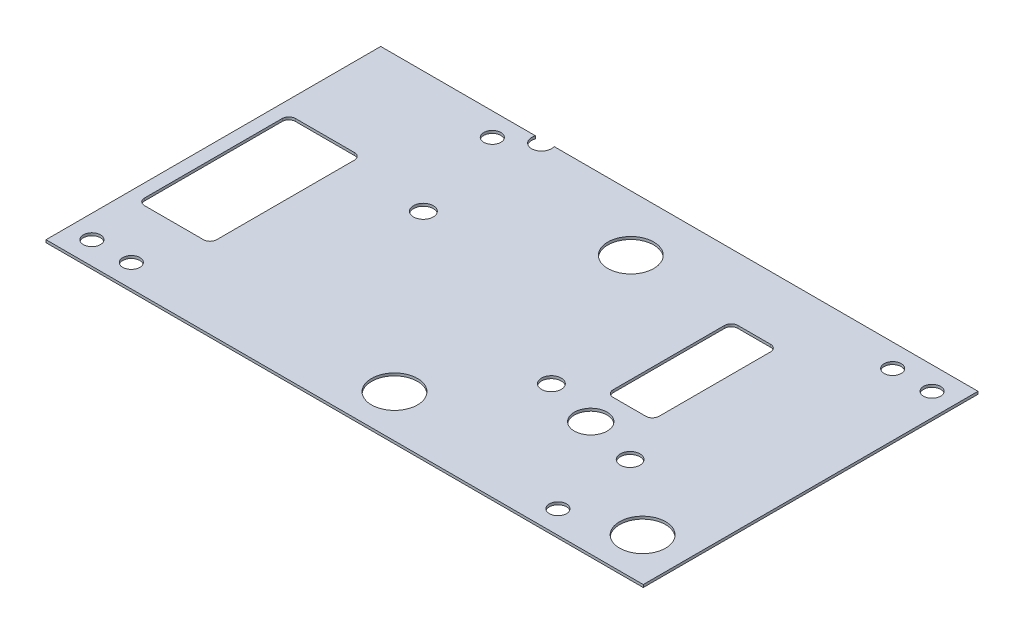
ISO-10303-21;
HEADER;
FILE_DESCRIPTION(('STEP AP214'),'2;1');
FILE_NAME('part.step','',(''),(''),'','','');
FILE_SCHEMA(('AUTOMOTIVE_DESIGN { 1 0 10303 214 1 1 1 1 }'));
ENDSEC;
DATA;
#1=APPLICATION_CONTEXT('core data for automotive mechanical design processes');
#2=APPLICATION_PROTOCOL_DEFINITION('international standard','automotive_design',2000,#1);
#3=PRODUCT_CONTEXT('',#1,'mechanical');
#4=PRODUCT('Part','Part','',(#3));
#5=PRODUCT_RELATED_PRODUCT_CATEGORY('part','',(#4));
#6=PRODUCT_DEFINITION_FORMATION('','',#4);
#7=PRODUCT_DEFINITION_CONTEXT('part definition',#1,'design');
#8=PRODUCT_DEFINITION('design','',#6,#7);
#9=PRODUCT_DEFINITION_SHAPE('','',#8);
#10=(LENGTH_UNIT() NAMED_UNIT(*) SI_UNIT(.MILLI.,.METRE.));
#11=(NAMED_UNIT(*) PLANE_ANGLE_UNIT() SI_UNIT($,.RADIAN.));
#12=(NAMED_UNIT(*) SI_UNIT($,.STERADIAN.) SOLID_ANGLE_UNIT());
#13=UNCERTAINTY_MEASURE_WITH_UNIT(LENGTH_MEASURE(1.E-05),#10,'distance_accuracy_value','');
#14=(GEOMETRIC_REPRESENTATION_CONTEXT(3) GLOBAL_UNCERTAINTY_ASSIGNED_CONTEXT((#13)) GLOBAL_UNIT_ASSIGNED_CONTEXT((#10,
#11,#12)) REPRESENTATION_CONTEXT('',''));
#15=CARTESIAN_POINT('',(0.,0.,0.));
#16=DIRECTION('',(0.,0.,1.));
#17=DIRECTION('',(1.,0.,0.));
#18=AXIS2_PLACEMENT_3D('',#15,#16,#17);
#19=CARTESIAN_POINT('',(-327.500732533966,-186.420000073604,306.499993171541));
#20=DIRECTION('',(0.,-1.,0.));
#21=DIRECTION('',(0.,0.,-1.));
#22=AXIS2_PLACEMENT_3D('',#19,#20,#21);
#23=PLANE('',#22);
#24=CARTESIAN_POINT('',(-202.501514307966,-186.420000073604,143.999992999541));
#25=DIRECTION('',(0.,-1.,0.));
#26=DIRECTION('',(0.,0.,-1.));
#27=AXIS2_PLACEMENT_3D('',#24,#25,#26);
#28=CIRCLE('',#27,7.50000000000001);
#29=CARTESIAN_POINT('',(-202.501514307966,-186.420000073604,136.499992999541));
#30=VERTEX_POINT('',#29);
#31=EDGE_CURVE('E368',#30,#30,#28,.T.);
#32=ORIENTED_EDGE('',*,*,#31,.T.);
#33=EDGE_LOOP('',(#32));
#34=FACE_BOUND('',#33,.T.);
#35=CARTESIAN_POINT('',(79.9992674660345,-186.420000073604,68.999993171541));
#36=DIRECTION('',(0.,-1.,0.));
#37=DIRECTION('',(0.,0.,-1.));
#38=AXIS2_PLACEMENT_3D('',#35,#36,#37);
#39=CIRCLE('',#38,6.5);
#40=CARTESIAN_POINT('',(79.9992674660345,-186.420000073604,62.499993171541));
#41=VERTEX_POINT('',#40);
#42=EDGE_CURVE('E366',#41,#41,#39,.T.);
#43=ORIENTED_EDGE('',*,*,#42,.T.);
#44=EDGE_LOOP('',(#43));
#45=FACE_BOUND('',#44,.T.);
#46=CARTESIAN_POINT('',(109.999267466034,-186.420000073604,68.999993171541));
#47=DIRECTION('',(0.,-1.,0.));
#48=DIRECTION('',(0.,0.,-1.));
#49=AXIS2_PLACEMENT_3D('',#46,#47,#48);
#50=CIRCLE('',#49,6.5);
#51=CARTESIAN_POINT('',(109.999267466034,-186.420000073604,62.499993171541));
#52=VERTEX_POINT('',#51);
#53=EDGE_CURVE('E363',#52,#52,#50,.T.);
#54=ORIENTED_EDGE('',*,*,#53,.T.);
#55=EDGE_LOOP('',(#54));
#56=FACE_BOUND('',#55,.T.);
#57=CARTESIAN_POINT('',(44.9992674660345,-186.420000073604,288.999993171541));
#58=DIRECTION('',(0.,-1.,0.));
#59=DIRECTION('',(0.,0.,-1.));
#60=AXIS2_PLACEMENT_3D('',#57,#58,#59);
#61=CIRCLE('',#60,6.50000000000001);
#62=CARTESIAN_POINT('',(44.9992674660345,-186.420000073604,282.499993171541));
#63=VERTEX_POINT('',#62);
#64=EDGE_CURVE('E360',#63,#63,#61,.T.);
#65=ORIENTED_EDGE('',*,*,#64,.T.);
#66=EDGE_LOOP('',(#65));
#67=FACE_BOUND('',#66,.T.);
#68=CARTESIAN_POINT('',(-225.000732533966,-186.420000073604,68.999993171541));
#69=DIRECTION('',(0.,-1.,0.));
#70=DIRECTION('',(0.,0.,-1.));
#71=AXIS2_PLACEMENT_3D('',#68,#69,#70);
#72=CIRCLE('',#71,6.5);
#73=CARTESIAN_POINT('',(-225.000732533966,-186.420000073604,62.4999931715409));
#74=VERTEX_POINT('',#73);
#75=EDGE_CURVE('E357',#74,#74,#72,.T.);
#76=ORIENTED_EDGE('',*,*,#75,.T.);
#77=EDGE_LOOP('',(#76));
#78=FACE_BOUND('',#77,.T.);
#79=CARTESIAN_POINT('',(-310.000732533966,-186.420000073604,288.999993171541));
#80=DIRECTION('',(0.,-1.,0.));
#81=DIRECTION('',(0.,0.,-1.));
#82=AXIS2_PLACEMENT_3D('',#79,#80,#81);
#83=CIRCLE('',#82,6.50000000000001);
#84=CARTESIAN_POINT('',(-310.000732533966,-186.420000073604,282.499993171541));
#85=VERTEX_POINT('',#84);
#86=EDGE_CURVE('E354',#85,#85,#83,.T.);
#87=ORIENTED_EDGE('',*,*,#86,.T.);
#88=EDGE_LOOP('',(#87));
#89=FACE_BOUND('',#88,.T.);
#90=CARTESIAN_POINT('',(-280.000732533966,-186.420000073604,288.999993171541));
#91=DIRECTION('',(0.,-1.,0.));
#92=DIRECTION('',(0.,0.,-1.));
#93=AXIS2_PLACEMENT_3D('',#90,#91,#92);
#94=CIRCLE('',#93,6.50000000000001);
#95=CARTESIAN_POINT('',(-280.000732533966,-186.420000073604,282.499993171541));
#96=VERTEX_POINT('',#95);
#97=EDGE_CURVE('E351',#96,#96,#94,.T.);
#98=ORIENTED_EDGE('',*,*,#97,.T.);
#99=EDGE_LOOP('',(#98));
#100=FACE_BOUND('',#99,.T.);
#101=CARTESIAN_POINT('',(94.5000000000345,-186.420000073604,273.999999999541));
#102=DIRECTION('',(0.,-1.,0.));
#103=DIRECTION('',(0.,0.,-1.));
#104=AXIS2_PLACEMENT_3D('',#101,#102,#103);
#105=CIRCLE('',#104,17.5);
#106=CARTESIAN_POINT('',(94.5000000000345,-186.420000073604,256.499999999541));
#107=VERTEX_POINT('',#106);
#108=EDGE_CURVE('E348',#107,#107,#105,.T.);
#109=ORIENTED_EDGE('',*,*,#108,.T.);
#110=EDGE_LOOP('',(#109));
#111=FACE_BOUND('',#110,.T.);
#112=CARTESIAN_POINT('',(-94.4999999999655,-186.420000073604,273.999999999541));
#113=DIRECTION('',(0.,-1.,0.));
#114=DIRECTION('',(0.,0.,-1.));
#115=AXIS2_PLACEMENT_3D('',#112,#113,#114);
#116=CIRCLE('',#115,17.5);
#117=CARTESIAN_POINT('',(-94.4999999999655,-186.420000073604,256.499999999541));
#118=VERTEX_POINT('',#117);
#119=EDGE_CURVE('E345',#118,#118,#116,.T.);
#120=ORIENTED_EDGE('',*,*,#119,.T.);
#121=EDGE_LOOP('',(#120));
#122=FACE_BOUND('',#121,.T.);
#123=CARTESIAN_POINT('',(-94.4999999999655,-186.420000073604,93.999999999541));
#124=DIRECTION('',(0.,-1.,0.));
#125=DIRECTION('',(0.,0.,-1.));
#126=AXIS2_PLACEMENT_3D('',#123,#124,#125);
#127=CIRCLE('',#126,17.5);
#128=CARTESIAN_POINT('',(-94.4999999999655,-186.420000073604,76.499999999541));
#129=VERTEX_POINT('',#128);
#130=EDGE_CURVE('E218',#129,#129,#127,.T.);
#131=ORIENTED_EDGE('',*,*,#130,.T.);
#132=EDGE_LOOP('',(#131));
#133=FACE_BOUND('',#132,.T.);
#134=DIRECTION('',(-1.,0.,0.));
#135=VECTOR('',#134,1.);
#136=CARTESIAN_POINT('',(-267.500732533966,-186.420000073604,131.499993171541));
#137=LINE('',#136,#135);
#138=CARTESIAN_POINT('',(-312.500732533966,-186.420000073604,131.499993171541));
#139=VERTEX_POINT('',#138);
#140=CARTESIAN_POINT('',(-267.500732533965,-186.420000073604,131.499993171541));
#141=VERTEX_POINT('',#140);
#142=EDGE_CURVE('E215',#139,#141,#137,.F.);
#143=ORIENTED_EDGE('',*,*,#142,.T.);
#144=CARTESIAN_POINT('',(-267.500732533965,-186.420000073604,136.499993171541));
#145=DIRECTION('',(0.,-1.,0.));
#146=DIRECTION('',(0.,0.,-1.));
#147=AXIS2_PLACEMENT_3D('',#144,#145,#146);
#148=CIRCLE('',#147,5.);
#149=CARTESIAN_POINT('',(-262.500732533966,-186.420000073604,136.499993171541));
#150=VERTEX_POINT('',#149);
#151=EDGE_CURVE('E341',#141,#150,#148,.T.);
#152=ORIENTED_EDGE('',*,*,#151,.T.);
#153=DIRECTION('',(0.,0.,1.));
#154=VECTOR('',#153,1.);
#155=CARTESIAN_POINT('',(-262.500732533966,-186.420000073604,241.499993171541));
#156=LINE('',#155,#154);
#157=CARTESIAN_POINT('',(-262.500732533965,-186.420000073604,241.499993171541));
#158=VERTEX_POINT('',#157);
#159=EDGE_CURVE('E227',#150,#158,#156,.T.);
#160=ORIENTED_EDGE('',*,*,#159,.T.);
#161=CARTESIAN_POINT('',(-267.500732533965,-186.420000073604,241.499993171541));
#162=DIRECTION('',(0.,-1.,0.));
#163=DIRECTION('',(0.,0.,-1.));
#164=AXIS2_PLACEMENT_3D('',#161,#162,#163);
#165=CIRCLE('',#164,5.);
#166=CARTESIAN_POINT('',(-267.500732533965,-186.420000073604,246.499993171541));
#167=VERTEX_POINT('',#166);
#168=EDGE_CURVE('E339',#158,#167,#165,.T.);
#169=ORIENTED_EDGE('',*,*,#168,.T.);
#170=DIRECTION('',(1.,0.,0.));
#171=VECTOR('',#170,1.);
#172=CARTESIAN_POINT('',(-312.500732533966,-186.420000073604,246.499993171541));
#173=LINE('',#172,#171);
#174=CARTESIAN_POINT('',(-312.500732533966,-186.420000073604,246.499993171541));
#175=VERTEX_POINT('',#174);
#176=EDGE_CURVE('E223',#167,#175,#173,.F.);
#177=ORIENTED_EDGE('',*,*,#176,.T.);
#178=CARTESIAN_POINT('',(-312.500732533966,-186.420000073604,241.499993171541));
#179=DIRECTION('',(0.,-1.,0.));
#180=DIRECTION('',(0.,0.,-1.));
#181=AXIS2_PLACEMENT_3D('',#178,#179,#180);
#182=CIRCLE('',#181,5.);
#183=CARTESIAN_POINT('',(-317.500732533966,-186.420000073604,241.499993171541));
#184=VERTEX_POINT('',#183);
#185=EDGE_CURVE('E337',#175,#184,#182,.T.);
#186=ORIENTED_EDGE('',*,*,#185,.T.);
#187=DIRECTION('',(0.,0.,1.));
#188=VECTOR('',#187,1.);
#189=CARTESIAN_POINT('',(-317.500732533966,-186.420000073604,136.499993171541));
#190=LINE('',#189,#188);
#191=CARTESIAN_POINT('',(-317.500732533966,-186.420000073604,136.499993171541));
#192=VERTEX_POINT('',#191);
#193=EDGE_CURVE('E219',#184,#192,#190,.F.);
#194=ORIENTED_EDGE('',*,*,#193,.T.);
#195=CARTESIAN_POINT('',(-312.500732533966,-186.420000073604,136.499993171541));
#196=DIRECTION('',(0.,-1.,0.));
#197=DIRECTION('',(0.,0.,-1.));
#198=AXIS2_PLACEMENT_3D('',#195,#196,#197);
#199=CIRCLE('',#198,5.);
#200=EDGE_CURVE('E334',#192,#139,#199,.T.);
#201=ORIENTED_EDGE('',*,*,#200,.T.);
#202=EDGE_LOOP('',(#143,#152,#160,#169,#177,#186,#194,#201));
#203=FACE_BOUND('',#202,.T.);
#204=CARTESIAN_POINT('',(17.4992674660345,-186.420000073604,104.499993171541));
#205=DIRECTION('',(0.,-1.,0.));
#206=DIRECTION('',(0.,0.,-1.));
#207=AXIS2_PLACEMENT_3D('',#204,#205,#206);
#208=CIRCLE('',#207,5.);
#209=CARTESIAN_POINT('',(17.4992674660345,-186.420000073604,99.499993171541));
#210=VERTEX_POINT('',#209);
#211=CARTESIAN_POINT('',(22.4992674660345,-186.420000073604,104.499993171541));
#212=VERTEX_POINT('',#211);
#213=EDGE_CURVE('E331',#210,#212,#208,.T.);
#214=ORIENTED_EDGE('',*,*,#213,.T.);
#215=DIRECTION('',(0.,0.,1.));
#216=VECTOR('',#215,1.);
#217=CARTESIAN_POINT('',(22.4992674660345,-186.420000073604,189.499993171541));
#218=LINE('',#217,#216);
#219=CARTESIAN_POINT('',(22.4992674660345,-186.420000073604,189.499993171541));
#220=VERTEX_POINT('',#219);
#221=EDGE_CURVE('E211',#212,#220,#218,.T.);
#222=ORIENTED_EDGE('',*,*,#221,.T.);
#223=CARTESIAN_POINT('',(17.4992674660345,-186.420000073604,189.499993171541));
#224=DIRECTION('',(0.,-1.,0.));
#225=DIRECTION('',(0.,0.,-1.));
#226=AXIS2_PLACEMENT_3D('',#223,#224,#225);
#227=CIRCLE('',#226,5.);
#228=CARTESIAN_POINT('',(17.4992674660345,-186.420000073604,194.499993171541));
#229=VERTEX_POINT('',#228);
#230=EDGE_CURVE('E329',#220,#229,#227,.T.);
#231=ORIENTED_EDGE('',*,*,#230,.T.);
#232=DIRECTION('',(1.,0.,0.));
#233=VECTOR('',#232,1.);
#234=CARTESIAN_POINT('',(-7.5007325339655,-186.420000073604,194.499993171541));
#235=LINE('',#234,#233);
#236=CARTESIAN_POINT('',(-7.5007325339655,-186.420000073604,194.499993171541));
#237=VERTEX_POINT('',#236);
#238=EDGE_CURVE('E207',#229,#237,#235,.F.);
#239=ORIENTED_EDGE('',*,*,#238,.T.);
#240=CARTESIAN_POINT('',(-7.5007325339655,-186.420000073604,189.499993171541));
#241=DIRECTION('',(0.,-1.,0.));
#242=DIRECTION('',(0.,0.,-1.));
#243=AXIS2_PLACEMENT_3D('',#240,#241,#242);
#244=CIRCLE('',#243,5.);
#245=CARTESIAN_POINT('',(-12.5007325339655,-186.420000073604,189.499993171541));
#246=VERTEX_POINT('',#245);
#247=EDGE_CURVE('E327',#237,#246,#244,.T.);
#248=ORIENTED_EDGE('',*,*,#247,.T.);
#249=DIRECTION('',(0.,0.,1.));
#250=VECTOR('',#249,1.);
#251=CARTESIAN_POINT('',(-12.5007325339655,-186.420000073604,104.499993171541));
#252=LINE('',#251,#250);
#253=CARTESIAN_POINT('',(-12.5007325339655,-186.420000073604,104.499993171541));
#254=VERTEX_POINT('',#253);
#255=EDGE_CURVE('E203',#246,#254,#252,.F.);
#256=ORIENTED_EDGE('',*,*,#255,.T.);
#257=CARTESIAN_POINT('',(-7.5007325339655,-186.420000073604,104.499993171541));
#258=DIRECTION('',(0.,-1.,0.));
#259=DIRECTION('',(0.,0.,-1.));
#260=AXIS2_PLACEMENT_3D('',#257,#258,#259);
#261=CIRCLE('',#260,5.);
#262=CARTESIAN_POINT('',(-7.5007325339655,-186.420000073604,99.499993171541));
#263=VERTEX_POINT('',#262);
#264=EDGE_CURVE('E325',#254,#263,#261,.T.);
#265=ORIENTED_EDGE('',*,*,#264,.T.);
#266=DIRECTION('',(-1.,0.,0.));
#267=VECTOR('',#266,1.);
#268=CARTESIAN_POINT('',(17.4992674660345,-186.420000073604,99.499993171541));
#269=LINE('',#268,#267);
#270=EDGE_CURVE('E199',#263,#210,#269,.F.);
#271=ORIENTED_EDGE('',*,*,#270,.T.);
#272=EDGE_LOOP('',(#214,#222,#231,#239,#248,#256,#265,#271));
#273=FACE_BOUND('',#272,.T.);
#274=CARTESIAN_POINT('',(-0.000732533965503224,-186.420000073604,218.999993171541));
#275=DIRECTION('',(0.,-1.,0.));
#276=DIRECTION('',(0.,0.,-1.));
#277=AXIS2_PLACEMENT_3D('',#274,#275,#276);
#278=CIRCLE('',#277,12.5);
#279=CARTESIAN_POINT('',(-0.000732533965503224,-186.420000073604,206.499993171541));
#280=VERTEX_POINT('',#279);
#281=EDGE_CURVE('E322',#280,#280,#278,.T.);
#282=ORIENTED_EDGE('',*,*,#281,.T.);
#283=EDGE_LOOP('',(#282));
#284=FACE_BOUND('',#283,.T.);
#285=CARTESIAN_POINT('',(39.9992674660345,-186.420000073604,228.999993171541));
#286=DIRECTION('',(0.,-1.,0.));
#287=DIRECTION('',(0.,0.,-1.));
#288=AXIS2_PLACEMENT_3D('',#285,#286,#287);
#289=CIRCLE('',#288,7.50000000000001);
#290=CARTESIAN_POINT('',(39.9992674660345,-186.420000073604,221.499993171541));
#291=VERTEX_POINT('',#290);
#292=EDGE_CURVE('E319',#291,#291,#289,.T.);
#293=ORIENTED_EDGE('',*,*,#292,.T.);
#294=EDGE_LOOP('',(#293));
#295=FACE_BOUND('',#294,.T.);
#296=CARTESIAN_POINT('',(-40.0007325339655,-186.420000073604,208.999993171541));
#297=DIRECTION('',(0.,-1.,0.));
#298=DIRECTION('',(0.,0.,-1.));
#299=AXIS2_PLACEMENT_3D('',#296,#297,#298);
#300=CIRCLE('',#299,7.50000000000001);
#301=CARTESIAN_POINT('',(-40.0007325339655,-186.420000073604,201.499993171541));
#302=VERTEX_POINT('',#301);
#303=EDGE_CURVE('E316',#302,#302,#300,.T.);
#304=ORIENTED_EDGE('',*,*,#303,.T.);
#305=EDGE_LOOP('',(#304));
#306=FACE_BOUND('',#305,.T.);
#307=CARTESIAN_POINT('',(-202.501514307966,-186.420000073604,53.9999929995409));
#308=DIRECTION('',(0.,-1.,0.));
#309=DIRECTION('',(0.,0.,-1.));
#310=AXIS2_PLACEMENT_3D('',#307,#308,#309);
#311=CIRCLE('',#310,7.5);
#312=CARTESIAN_POINT('',(-195.430446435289,-186.420000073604,51.499993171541));
#313=VERTEX_POINT('',#312);
#314=CARTESIAN_POINT('',(-209.572582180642,-186.420000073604,51.499993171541));
#315=VERTEX_POINT('',#314);
#316=EDGE_CURVE('E19',#313,#315,#311,.T.);
#317=ORIENTED_EDGE('',*,*,#316,.T.);
#318=DIRECTION('',(-1.,0.,0.));
#319=VECTOR('',#318,1.);
#320=CARTESIAN_POINT('',(-327.500732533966,-186.420000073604,51.499993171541));
#321=LINE('',#320,#319);
#322=CARTESIAN_POINT('',(-327.500732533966,-186.420000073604,51.499993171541));
#323=VERTEX_POINT('',#322);
#324=EDGE_CURVE('E143',#323,#315,#321,.F.);
#325=ORIENTED_EDGE('',*,*,#324,.F.);
#326=DIRECTION('',(0.,0.,1.));
#327=VECTOR('',#326,1.);
#328=CARTESIAN_POINT('',(-327.500732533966,-186.420000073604,306.499993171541));
#329=LINE('',#328,#327);
#330=CARTESIAN_POINT('',(-327.500732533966,-186.420000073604,306.499993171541));
#331=VERTEX_POINT('',#330);
#332=EDGE_CURVE('E176',#331,#323,#329,.F.);
#333=ORIENTED_EDGE('',*,*,#332,.F.);
#334=DIRECTION('',(1.,0.,0.));
#335=VECTOR('',#334,1.);
#336=CARTESIAN_POINT('',(127.499267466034,-186.420000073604,306.499993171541));
#337=LINE('',#336,#335);
#338=CARTESIAN_POINT('',(127.499267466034,-186.420000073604,306.499993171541));
#339=VERTEX_POINT('',#338);
#340=EDGE_CURVE('E190',#339,#331,#337,.F.);
#341=ORIENTED_EDGE('',*,*,#340,.F.);
#342=DIRECTION('',(0.,0.,1.));
#343=VECTOR('',#342,1.);
#344=CARTESIAN_POINT('',(127.499267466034,-186.420000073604,51.499993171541));
#345=LINE('',#344,#343);
#346=CARTESIAN_POINT('',(127.499267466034,-186.420000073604,51.499993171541));
#347=VERTEX_POINT('',#346);
#348=EDGE_CURVE('E238',#347,#339,#345,.T.);
#349=ORIENTED_EDGE('',*,*,#348,.F.);
#350=DIRECTION('',(-1.,0.,0.));
#351=VECTOR('',#350,1.);
#352=CARTESIAN_POINT('',(-327.500732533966,-186.420000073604,51.499993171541));
#353=LINE('',#352,#351);
#354=EDGE_CURVE('E156',#313,#347,#353,.F.);
#355=ORIENTED_EDGE('',*,*,#354,.F.);
#356=EDGE_LOOP('',(#317,#325,#333,#341,#349,#355));
#357=FACE_BOUND('',#356,.T.);
#358=ADVANCED_FACE('F15',(#34,#45,#56,#67,#78,#89,#100,#111,#122,#133,#203,#273,#284,#295,#306,
#357),#23,.F.);
#359=CARTESIAN_POINT('',(-327.500732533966,-188.420000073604,51.499993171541));
#360=DIRECTION('',(0.,0.,-1.));
#361=DIRECTION('',(-1.,0.,0.));
#362=AXIS2_PLACEMENT_3D('',#359,#360,#361);
#363=PLANE('',#362);
#364=DIRECTION('',(0.,1.,0.));
#365=VECTOR('',#364,1.);
#366=CARTESIAN_POINT('',(-327.500732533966,-188.420000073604,51.499993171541));
#367=LINE('',#366,#365);
#368=CARTESIAN_POINT('',(-327.500732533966,-188.420000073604,51.499993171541));
#369=VERTEX_POINT('',#368);
#370=EDGE_CURVE('E179',#323,#369,#367,.F.);
#371=ORIENTED_EDGE('',*,*,#370,.F.);
#372=ORIENTED_EDGE('',*,*,#324,.T.);
#373=DIRECTION('',(0.,-1.,0.));
#374=VECTOR('',#373,1.);
#375=CARTESIAN_POINT('',(-209.572582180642,-708.007960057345,51.499993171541));
#376=LINE('',#375,#374);
#377=CARTESIAN_POINT('',(-209.572582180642,-188.420000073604,51.499993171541));
#378=VERTEX_POINT('',#377);
#379=EDGE_CURVE('E370',#315,#378,#376,.T.);
#380=ORIENTED_EDGE('',*,*,#379,.T.);
#381=DIRECTION('',(1.,0.,0.));
#382=VECTOR('',#381,1.);
#383=CARTESIAN_POINT('',(-100.000732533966,-188.420000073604,51.499993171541));
#384=LINE('',#383,#382);
#385=EDGE_CURVE('E189',#378,#369,#384,.F.);
#386=ORIENTED_EDGE('',*,*,#385,.T.);
#387=EDGE_LOOP('',(#371,#372,#380,#386));
#388=FACE_BOUND('',#387,.T.);
#389=ADVANCED_FACE('F187',(#388),#363,.T.);
#390=CARTESIAN_POINT('',(-327.500732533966,-188.420000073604,306.499993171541));
#391=DIRECTION('',(-1.,0.,0.));
#392=DIRECTION('',(0.,0.,1.));
#393=AXIS2_PLACEMENT_3D('',#390,#391,#392);
#394=PLANE('',#393);
#395=DIRECTION('',(0.,0.,1.));
#396=VECTOR('',#395,1.);
#397=CARTESIAN_POINT('',(-327.500732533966,-188.420000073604,178.999993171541));
#398=LINE('',#397,#396);
#399=CARTESIAN_POINT('',(-327.500732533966,-188.420000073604,306.499993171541));
#400=VERTEX_POINT('',#399);
#401=EDGE_CURVE('E394',#369,#400,#398,.T.);
#402=ORIENTED_EDGE('',*,*,#401,.T.);
#403=DIRECTION('',(0.,-1.,0.));
#404=VECTOR('',#403,1.);
#405=CARTESIAN_POINT('',(-327.500732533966,-188.420000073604,306.499993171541));
#406=LINE('',#405,#404);
#407=EDGE_CURVE('E181',#331,#400,#406,.T.);
#408=ORIENTED_EDGE('',*,*,#407,.F.);
#409=ORIENTED_EDGE('',*,*,#332,.T.);
#410=ORIENTED_EDGE('',*,*,#370,.T.);
#411=EDGE_LOOP('',(#402,#408,#409,#410));
#412=FACE_BOUND('',#411,.T.);
#413=ADVANCED_FACE('F178',(#412),#394,.T.);
#414=CARTESIAN_POINT('',(127.499267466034,-188.420000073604,306.499993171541));
#415=DIRECTION('',(0.,0.,1.));
#416=DIRECTION('',(0.,-1.,0.));
#417=AXIS2_PLACEMENT_3D('',#414,#415,#416);
#418=PLANE('',#417);
#419=DIRECTION('',(1.,0.,0.));
#420=VECTOR('',#419,1.);
#421=CARTESIAN_POINT('',(-100.000732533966,-188.420000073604,306.499993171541));
#422=LINE('',#421,#420);
#423=CARTESIAN_POINT('',(127.499267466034,-188.420000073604,306.499993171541));
#424=VERTEX_POINT('',#423);
#425=EDGE_CURVE('E385',#400,#424,#422,.T.);
#426=ORIENTED_EDGE('',*,*,#425,.T.);
#427=DIRECTION('',(0.,1.,0.));
#428=VECTOR('',#427,1.);
#429=CARTESIAN_POINT('',(127.499267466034,-188.420000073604,306.499993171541));
#430=LINE('',#429,#428);
#431=EDGE_CURVE('E235',#339,#424,#430,.F.);
#432=ORIENTED_EDGE('',*,*,#431,.F.);
#433=ORIENTED_EDGE('',*,*,#340,.T.);
#434=ORIENTED_EDGE('',*,*,#407,.T.);
#435=EDGE_LOOP('',(#426,#432,#433,#434));
#436=FACE_BOUND('',#435,.T.);
#437=ADVANCED_FACE('F465',(#436),#418,.T.);
#438=CARTESIAN_POINT('',(127.499267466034,-188.420000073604,51.499993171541));
#439=DIRECTION('',(1.,0.,0.));
#440=DIRECTION('',(0.,1.,0.));
#441=AXIS2_PLACEMENT_3D('',#438,#439,#440);
#442=PLANE('',#441);
#443=DIRECTION('',(0.,0.,1.));
#444=VECTOR('',#443,1.);
#445=CARTESIAN_POINT('',(127.499267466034,-188.420000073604,178.999993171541));
#446=LINE('',#445,#444);
#447=CARTESIAN_POINT('',(127.499267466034,-188.420000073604,51.499993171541));
#448=VERTEX_POINT('',#447);
#449=EDGE_CURVE('E382',#424,#448,#446,.F.);
#450=ORIENTED_EDGE('',*,*,#449,.T.);
#451=DIRECTION('',(0.,1.,0.));
#452=VECTOR('',#451,1.);
#453=CARTESIAN_POINT('',(127.499267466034,-188.420000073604,51.499993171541));
#454=LINE('',#453,#452);
#455=EDGE_CURVE('E234',#347,#448,#454,.F.);
#456=ORIENTED_EDGE('',*,*,#455,.F.);
#457=ORIENTED_EDGE('',*,*,#348,.T.);
#458=ORIENTED_EDGE('',*,*,#431,.T.);
#459=EDGE_LOOP('',(#450,#456,#457,#458));
#460=FACE_BOUND('',#459,.T.);
#461=ADVANCED_FACE('F462',(#460),#442,.T.);
#462=CARTESIAN_POINT('',(-327.500732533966,-188.420000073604,51.499993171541));
#463=DIRECTION('',(0.,0.,-1.));
#464=DIRECTION('',(-1.,0.,0.));
#465=AXIS2_PLACEMENT_3D('',#462,#463,#464);
#466=PLANE('',#465);
#467=ORIENTED_EDGE('',*,*,#455,.T.);
#468=DIRECTION('',(1.,0.,0.));
#469=VECTOR('',#468,1.);
#470=CARTESIAN_POINT('',(-100.000732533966,-188.420000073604,51.499993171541));
#471=LINE('',#470,#469);
#472=CARTESIAN_POINT('',(-195.430446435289,-188.420000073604,51.499993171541));
#473=VERTEX_POINT('',#472);
#474=EDGE_CURVE('E315',#448,#473,#471,.F.);
#475=ORIENTED_EDGE('',*,*,#474,.T.);
#476=DIRECTION('',(0.,-1.,0.));
#477=VECTOR('',#476,1.);
#478=CARTESIAN_POINT('',(-195.430446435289,-708.007960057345,51.499993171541));
#479=LINE('',#478,#477);
#480=EDGE_CURVE('E374',#473,#313,#479,.F.);
#481=ORIENTED_EDGE('',*,*,#480,.T.);
#482=ORIENTED_EDGE('',*,*,#354,.T.);
#483=EDGE_LOOP('',(#467,#475,#481,#482));
#484=FACE_BOUND('',#483,.T.);
#485=ADVANCED_FACE('F455',(#484),#466,.T.);
#486=CARTESIAN_POINT('',(-202.501514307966,-186.420000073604,53.9999929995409));
#487=DIRECTION('',(0.,-1.,0.));
#488=DIRECTION('',(0.,0.,-1.));
#489=AXIS2_PLACEMENT_3D('',#486,#487,#488);
#490=CYLINDRICAL_SURFACE('',#489,7.5);
#491=CARTESIAN_POINT('',(-202.501514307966,-188.420000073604,53.9999929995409));
#492=DIRECTION('',(0.,-1.,0.));
#493=DIRECTION('',(0.,0.,-1.));
#494=AXIS2_PLACEMENT_3D('',#491,#492,#493);
#495=CIRCLE('',#494,7.5);
#496=EDGE_CURVE('E313',#473,#378,#495,.T.);
#497=ORIENTED_EDGE('',*,*,#496,.T.);
#498=ORIENTED_EDGE('',*,*,#379,.F.);
#499=ORIENTED_EDGE('',*,*,#316,.F.);
#500=ORIENTED_EDGE('',*,*,#480,.F.);
#501=EDGE_LOOP('',(#497,#498,#499,#500));
#502=FACE_BOUND('',#501,.T.);
#503=ADVANCED_FACE('F607',(#502),#490,.F.);
#504=CARTESIAN_POINT('',(-202.501514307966,-186.420000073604,143.999992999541));
#505=DIRECTION('',(0.,-1.,0.));
#506=DIRECTION('',(0.,0.,-1.));
#507=AXIS2_PLACEMENT_3D('',#504,#505,#506);
#508=CYLINDRICAL_SURFACE('',#507,7.50000000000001);
#509=CARTESIAN_POINT('',(-202.501514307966,-188.420000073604,143.999992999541));
#510=DIRECTION('',(0.,-1.,0.));
#511=DIRECTION('',(0.,0.,-1.));
#512=AXIS2_PLACEMENT_3D('',#509,#510,#511);
#513=CIRCLE('',#512,7.50000000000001);
#514=CARTESIAN_POINT('',(-202.501514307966,-188.420000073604,136.499992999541));
#515=VERTEX_POINT('',#514);
#516=EDGE_CURVE('E310',#515,#515,#513,.T.);
#517=ORIENTED_EDGE('',*,*,#516,.T.);
#518=EDGE_LOOP('',(#517));
#519=FACE_BOUND('',#518,.T.);
#520=ORIENTED_EDGE('',*,*,#31,.F.);
#521=EDGE_LOOP('',(#520));
#522=FACE_BOUND('',#521,.T.);
#523=ADVANCED_FACE('F604',(#519,#522),#508,.F.);
#524=CARTESIAN_POINT('',(79.9992674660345,-186.420000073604,68.999993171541));
#525=DIRECTION('',(0.,-1.,0.));
#526=DIRECTION('',(0.,0.,-1.));
#527=AXIS2_PLACEMENT_3D('',#524,#525,#526);
#528=CYLINDRICAL_SURFACE('',#527,6.5);
#529=CARTESIAN_POINT('',(79.9992674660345,-188.420000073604,68.999993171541));
#530=DIRECTION('',(0.,-1.,0.));
#531=DIRECTION('',(0.,0.,-1.));
#532=AXIS2_PLACEMENT_3D('',#529,#530,#531);
#533=CIRCLE('',#532,6.5);
#534=CARTESIAN_POINT('',(79.9992674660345,-188.420000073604,62.499993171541));
#535=VERTEX_POINT('',#534);
#536=EDGE_CURVE('E307',#535,#535,#533,.T.);
#537=ORIENTED_EDGE('',*,*,#536,.T.);
#538=EDGE_LOOP('',(#537));
#539=FACE_BOUND('',#538,.T.);
#540=ORIENTED_EDGE('',*,*,#42,.F.);
#541=EDGE_LOOP('',(#540));
#542=FACE_BOUND('',#541,.T.);
#543=ADVANCED_FACE('F601',(#539,#542),#528,.F.);
#544=CARTESIAN_POINT('',(109.999267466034,-186.420000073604,68.999993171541));
#545=DIRECTION('',(0.,-1.,0.));
#546=DIRECTION('',(0.,0.,-1.));
#547=AXIS2_PLACEMENT_3D('',#544,#545,#546);
#548=CYLINDRICAL_SURFACE('',#547,6.5);
#549=CARTESIAN_POINT('',(109.999267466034,-188.420000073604,68.999993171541));
#550=DIRECTION('',(0.,-1.,0.));
#551=DIRECTION('',(0.,0.,-1.));
#552=AXIS2_PLACEMENT_3D('',#549,#550,#551);
#553=CIRCLE('',#552,6.5);
#554=CARTESIAN_POINT('',(109.999267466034,-188.420000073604,62.499993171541));
#555=VERTEX_POINT('',#554);
#556=EDGE_CURVE('E304',#555,#555,#553,.T.);
#557=ORIENTED_EDGE('',*,*,#556,.T.);
#558=EDGE_LOOP('',(#557));
#559=FACE_BOUND('',#558,.T.);
#560=ORIENTED_EDGE('',*,*,#53,.F.);
#561=EDGE_LOOP('',(#560));
#562=FACE_BOUND('',#561,.T.);
#563=ADVANCED_FACE('F598',(#559,#562),#548,.F.);
#564=CARTESIAN_POINT('',(44.9992674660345,-186.420000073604,288.999993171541));
#565=DIRECTION('',(0.,-1.,0.));
#566=DIRECTION('',(0.,0.,-1.));
#567=AXIS2_PLACEMENT_3D('',#564,#565,#566);
#568=CYLINDRICAL_SURFACE('',#567,6.50000000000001);
#569=CARTESIAN_POINT('',(44.9992674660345,-188.420000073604,288.999993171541));
#570=DIRECTION('',(0.,-1.,0.));
#571=DIRECTION('',(0.,0.,-1.));
#572=AXIS2_PLACEMENT_3D('',#569,#570,#571);
#573=CIRCLE('',#572,6.50000000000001);
#574=CARTESIAN_POINT('',(44.9992674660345,-188.420000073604,282.499993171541));
#575=VERTEX_POINT('',#574);
#576=EDGE_CURVE('E301',#575,#575,#573,.T.);
#577=ORIENTED_EDGE('',*,*,#576,.T.);
#578=EDGE_LOOP('',(#577));
#579=FACE_BOUND('',#578,.T.);
#580=ORIENTED_EDGE('',*,*,#64,.F.);
#581=EDGE_LOOP('',(#580));
#582=FACE_BOUND('',#581,.T.);
#583=ADVANCED_FACE('F595',(#579,#582),#568,.F.);
#584=CARTESIAN_POINT('',(-225.000732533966,-186.420000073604,68.999993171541));
#585=DIRECTION('',(0.,-1.,0.));
#586=DIRECTION('',(0.,0.,-1.));
#587=AXIS2_PLACEMENT_3D('',#584,#585,#586);
#588=CYLINDRICAL_SURFACE('',#587,6.5);
#589=CARTESIAN_POINT('',(-225.000732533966,-188.420000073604,68.999993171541));
#590=DIRECTION('',(0.,-1.,0.));
#591=DIRECTION('',(0.,0.,-1.));
#592=AXIS2_PLACEMENT_3D('',#589,#590,#591);
#593=CIRCLE('',#592,6.5);
#594=CARTESIAN_POINT('',(-225.000732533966,-188.420000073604,62.4999931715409));
#595=VERTEX_POINT('',#594);
#596=EDGE_CURVE('E298',#595,#595,#593,.T.);
#597=ORIENTED_EDGE('',*,*,#596,.T.);
#598=EDGE_LOOP('',(#597));
#599=FACE_BOUND('',#598,.T.);
#600=ORIENTED_EDGE('',*,*,#75,.F.);
#601=EDGE_LOOP('',(#600));
#602=FACE_BOUND('',#601,.T.);
#603=ADVANCED_FACE('F592',(#599,#602),#588,.F.);
#604=CARTESIAN_POINT('',(-310.000732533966,-186.420000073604,288.999993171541));
#605=DIRECTION('',(0.,-1.,0.));
#606=DIRECTION('',(0.,0.,-1.));
#607=AXIS2_PLACEMENT_3D('',#604,#605,#606);
#608=CYLINDRICAL_SURFACE('',#607,6.50000000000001);
#609=CARTESIAN_POINT('',(-310.000732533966,-188.420000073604,288.999993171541));
#610=DIRECTION('',(0.,-1.,0.));
#611=DIRECTION('',(0.,0.,-1.));
#612=AXIS2_PLACEMENT_3D('',#609,#610,#611);
#613=CIRCLE('',#612,6.50000000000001);
#614=CARTESIAN_POINT('',(-310.000732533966,-188.420000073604,282.499993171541));
#615=VERTEX_POINT('',#614);
#616=EDGE_CURVE('E295',#615,#615,#613,.T.);
#617=ORIENTED_EDGE('',*,*,#616,.T.);
#618=EDGE_LOOP('',(#617));
#619=FACE_BOUND('',#618,.T.);
#620=ORIENTED_EDGE('',*,*,#86,.F.);
#621=EDGE_LOOP('',(#620));
#622=FACE_BOUND('',#621,.T.);
#623=ADVANCED_FACE('F589',(#619,#622),#608,.F.);
#624=CARTESIAN_POINT('',(-280.000732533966,-186.420000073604,288.999993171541));
#625=DIRECTION('',(0.,-1.,0.));
#626=DIRECTION('',(0.,0.,-1.));
#627=AXIS2_PLACEMENT_3D('',#624,#625,#626);
#628=CYLINDRICAL_SURFACE('',#627,6.50000000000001);
#629=CARTESIAN_POINT('',(-280.000732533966,-188.420000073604,288.999993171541));
#630=DIRECTION('',(0.,-1.,0.));
#631=DIRECTION('',(0.,0.,-1.));
#632=AXIS2_PLACEMENT_3D('',#629,#630,#631);
#633=CIRCLE('',#632,6.50000000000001);
#634=CARTESIAN_POINT('',(-280.000732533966,-188.420000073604,282.499993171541));
#635=VERTEX_POINT('',#634);
#636=EDGE_CURVE('E292',#635,#635,#633,.T.);
#637=ORIENTED_EDGE('',*,*,#636,.T.);
#638=EDGE_LOOP('',(#637));
#639=FACE_BOUND('',#638,.T.);
#640=ORIENTED_EDGE('',*,*,#97,.F.);
#641=EDGE_LOOP('',(#640));
#642=FACE_BOUND('',#641,.T.);
#643=ADVANCED_FACE('F586',(#639,#642),#628,.F.);
#644=CARTESIAN_POINT('',(94.5000000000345,-186.420000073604,273.999999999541));
#645=DIRECTION('',(0.,-1.,0.));
#646=DIRECTION('',(0.,0.,-1.));
#647=AXIS2_PLACEMENT_3D('',#644,#645,#646);
#648=CYLINDRICAL_SURFACE('',#647,17.5);
#649=CARTESIAN_POINT('',(94.5000000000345,-188.420000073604,273.999999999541));
#650=DIRECTION('',(0.,-1.,0.));
#651=DIRECTION('',(0.,0.,-1.));
#652=AXIS2_PLACEMENT_3D('',#649,#650,#651);
#653=CIRCLE('',#652,17.5);
#654=CARTESIAN_POINT('',(94.5000000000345,-188.420000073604,256.499999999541));
#655=VERTEX_POINT('',#654);
#656=EDGE_CURVE('E289',#655,#655,#653,.T.);
#657=ORIENTED_EDGE('',*,*,#656,.T.);
#658=EDGE_LOOP('',(#657));
#659=FACE_BOUND('',#658,.T.);
#660=ORIENTED_EDGE('',*,*,#108,.F.);
#661=EDGE_LOOP('',(#660));
#662=FACE_BOUND('',#661,.T.);
#663=ADVANCED_FACE('F577',(#659,#662),#648,.F.);
#664=CARTESIAN_POINT('',(-94.4999999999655,-186.420000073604,273.999999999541));
#665=DIRECTION('',(0.,-1.,0.));
#666=DIRECTION('',(0.,0.,-1.));
#667=AXIS2_PLACEMENT_3D('',#664,#665,#666);
#668=CYLINDRICAL_SURFACE('',#667,17.5);
#669=CARTESIAN_POINT('',(-94.4999999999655,-188.420000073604,273.999999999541));
#670=DIRECTION('',(0.,-1.,0.));
#671=DIRECTION('',(0.,0.,-1.));
#672=AXIS2_PLACEMENT_3D('',#669,#670,#671);
#673=CIRCLE('',#672,17.5);
#674=CARTESIAN_POINT('',(-94.4999999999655,-188.420000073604,256.499999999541));
#675=VERTEX_POINT('',#674);
#676=EDGE_CURVE('E286',#675,#675,#673,.T.);
#677=ORIENTED_EDGE('',*,*,#676,.T.);
#678=EDGE_LOOP('',(#677));
#679=FACE_BOUND('',#678,.T.);
#680=ORIENTED_EDGE('',*,*,#119,.F.);
#681=EDGE_LOOP('',(#680));
#682=FACE_BOUND('',#681,.T.);
#683=ADVANCED_FACE('F573',(#679,#682),#668,.F.);
#684=CARTESIAN_POINT('',(-94.4999999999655,-186.420000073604,93.999999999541));
#685=DIRECTION('',(0.,-1.,0.));
#686=DIRECTION('',(0.,0.,-1.));
#687=AXIS2_PLACEMENT_3D('',#684,#685,#686);
#688=CYLINDRICAL_SURFACE('',#687,17.5);
#689=CARTESIAN_POINT('',(-94.4999999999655,-188.420000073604,93.999999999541));
#690=DIRECTION('',(0.,-1.,0.));
#691=DIRECTION('',(0.,0.,-1.));
#692=AXIS2_PLACEMENT_3D('',#689,#690,#691);
#693=CIRCLE('',#692,17.5);
#694=CARTESIAN_POINT('',(-94.4999999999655,-188.420000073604,76.499999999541));
#695=VERTEX_POINT('',#694);
#696=EDGE_CURVE('E283',#695,#695,#693,.T.);
#697=ORIENTED_EDGE('',*,*,#696,.T.);
#698=EDGE_LOOP('',(#697));
#699=FACE_BOUND('',#698,.T.);
#700=ORIENTED_EDGE('',*,*,#130,.F.);
#701=EDGE_LOOP('',(#700));
#702=FACE_BOUND('',#701,.T.);
#703=ADVANCED_FACE('F572',(#699,#702),#688,.F.);
#704=CARTESIAN_POINT('',(-267.500732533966,-186.420000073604,131.499993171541));
#705=DIRECTION('',(0.,0.,-1.));
#706=DIRECTION('',(-1.,0.,0.));
#707=AXIS2_PLACEMENT_3D('',#704,#705,#706);
#708=PLANE('',#707);
#709=DIRECTION('',(0.,-1.,0.));
#710=VECTOR('',#709,1.);
#711=CARTESIAN_POINT('',(-267.500732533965,-186.420000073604,131.499993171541));
#712=LINE('',#711,#710);
#713=CARTESIAN_POINT('',(-267.500732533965,-188.420000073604,131.499993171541));
#714=VERTEX_POINT('',#713);
#715=EDGE_CURVE('E217',#714,#141,#712,.F.);
#716=ORIENTED_EDGE('',*,*,#715,.T.);
#717=ORIENTED_EDGE('',*,*,#142,.F.);
#718=DIRECTION('',(0.,-1.,0.));
#719=VECTOR('',#718,1.);
#720=CARTESIAN_POINT('',(-312.500732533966,-186.420000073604,131.499993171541));
#721=LINE('',#720,#719);
#722=CARTESIAN_POINT('',(-312.500732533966,-188.420000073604,131.499993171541));
#723=VERTEX_POINT('',#722);
#724=EDGE_CURVE('E333',#139,#723,#721,.T.);
#725=ORIENTED_EDGE('',*,*,#724,.T.);
#726=DIRECTION('',(1.,0.,0.));
#727=VECTOR('',#726,1.);
#728=CARTESIAN_POINT('',(-100.000732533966,-188.420000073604,131.499993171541));
#729=LINE('',#728,#727);
#730=EDGE_CURVE('E282',#723,#714,#729,.T.);
#731=ORIENTED_EDGE('',*,*,#730,.T.);
#732=EDGE_LOOP('',(#716,#717,#725,#731));
#733=FACE_BOUND('',#732,.T.);
#734=ADVANCED_FACE('F514',(#733),#708,.F.);
#735=CARTESIAN_POINT('',(-267.500732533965,-186.420000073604,136.499993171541));
#736=DIRECTION('',(0.,-1.,0.));
#737=DIRECTION('',(0.,0.,-1.));
#738=AXIS2_PLACEMENT_3D('',#735,#736,#737);
#739=CYLINDRICAL_SURFACE('',#738,5.);
#740=DIRECTION('',(0.,1.,0.));
#741=VECTOR('',#740,1.);
#742=CARTESIAN_POINT('',(-262.500732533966,-186.420000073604,136.499993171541));
#743=LINE('',#742,#741);
#744=CARTESIAN_POINT('',(-262.500732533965,-188.420000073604,136.499993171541));
#745=VERTEX_POINT('',#744);
#746=EDGE_CURVE('E229',#745,#150,#743,.T.);
#747=ORIENTED_EDGE('',*,*,#746,.T.);
#748=ORIENTED_EDGE('',*,*,#151,.F.);
#749=ORIENTED_EDGE('',*,*,#715,.F.);
#750=CARTESIAN_POINT('',(-267.500732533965,-188.420000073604,136.499993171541));
#751=DIRECTION('',(0.,-1.,0.));
#752=DIRECTION('',(0.,0.,-1.));
#753=AXIS2_PLACEMENT_3D('',#750,#751,#752);
#754=CIRCLE('',#753,5.);
#755=EDGE_CURVE('E279',#714,#745,#754,.T.);
#756=ORIENTED_EDGE('',*,*,#755,.T.);
#757=EDGE_LOOP('',(#747,#748,#749,#756));
#758=FACE_BOUND('',#757,.T.);
#759=ADVANCED_FACE('F435',(#758),#739,.F.);
#760=CARTESIAN_POINT('',(-262.500732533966,-186.420000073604,241.499993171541));
#761=DIRECTION('',(1.,0.,0.));
#762=DIRECTION('',(0.,1.,0.));
#763=AXIS2_PLACEMENT_3D('',#760,#761,#762);
#764=PLANE('',#763);
#765=DIRECTION('',(0.,-1.,0.));
#766=VECTOR('',#765,1.);
#767=CARTESIAN_POINT('',(-262.500732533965,-186.420000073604,241.499993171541));
#768=LINE('',#767,#766);
#769=CARTESIAN_POINT('',(-262.500732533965,-188.420000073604,241.499993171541));
#770=VERTEX_POINT('',#769);
#771=EDGE_CURVE('E228',#770,#158,#768,.F.);
#772=ORIENTED_EDGE('',*,*,#771,.T.);
#773=ORIENTED_EDGE('',*,*,#159,.F.);
#774=ORIENTED_EDGE('',*,*,#746,.F.);
#775=DIRECTION('',(0.,0.,1.));
#776=VECTOR('',#775,1.);
#777=CARTESIAN_POINT('',(-262.500732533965,-188.420000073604,178.999993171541));
#778=LINE('',#777,#776);
#779=EDGE_CURVE('E278',#745,#770,#778,.T.);
#780=ORIENTED_EDGE('',*,*,#779,.T.);
#781=EDGE_LOOP('',(#772,#773,#774,#780));
#782=FACE_BOUND('',#781,.T.);
#783=ADVANCED_FACE('F442',(#782),#764,.F.);
#784=CARTESIAN_POINT('',(-267.500732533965,-186.420000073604,241.499993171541));
#785=DIRECTION('',(0.,-1.,0.));
#786=DIRECTION('',(0.,0.,-1.));
#787=AXIS2_PLACEMENT_3D('',#784,#785,#786);
#788=CYLINDRICAL_SURFACE('',#787,5.);
#789=DIRECTION('',(0.,-1.,0.));
#790=VECTOR('',#789,1.);
#791=CARTESIAN_POINT('',(-267.500732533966,-186.420000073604,246.499993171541));
#792=LINE('',#791,#790);
#793=CARTESIAN_POINT('',(-267.500732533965,-188.420000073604,246.499993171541));
#794=VERTEX_POINT('',#793);
#795=EDGE_CURVE('E226',#794,#167,#792,.F.);
#796=ORIENTED_EDGE('',*,*,#795,.T.);
#797=ORIENTED_EDGE('',*,*,#168,.F.);
#798=ORIENTED_EDGE('',*,*,#771,.F.);
#799=CARTESIAN_POINT('',(-267.500732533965,-188.420000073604,241.499993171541));
#800=DIRECTION('',(0.,-1.,0.));
#801=DIRECTION('',(0.,0.,-1.));
#802=AXIS2_PLACEMENT_3D('',#799,#800,#801);
#803=CIRCLE('',#802,5.);
#804=EDGE_CURVE('E275',#770,#794,#803,.T.);
#805=ORIENTED_EDGE('',*,*,#804,.T.);
#806=EDGE_LOOP('',(#796,#797,#798,#805));
#807=FACE_BOUND('',#806,.T.);
#808=ADVANCED_FACE('F507',(#807),#788,.F.);
#809=CARTESIAN_POINT('',(-312.500732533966,-186.420000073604,246.499993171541));
#810=DIRECTION('',(0.,0.,1.));
#811=DIRECTION('',(0.,-1.,0.));
#812=AXIS2_PLACEMENT_3D('',#809,#810,#811);
#813=PLANE('',#812);
#814=DIRECTION('',(0.,-1.,0.));
#815=VECTOR('',#814,1.);
#816=CARTESIAN_POINT('',(-312.500732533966,-186.420000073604,246.499993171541));
#817=LINE('',#816,#815);
#818=CARTESIAN_POINT('',(-312.500732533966,-188.420000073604,246.499993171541));
#819=VERTEX_POINT('',#818);
#820=EDGE_CURVE('E225',#819,#175,#817,.F.);
#821=ORIENTED_EDGE('',*,*,#820,.T.);
#822=ORIENTED_EDGE('',*,*,#176,.F.);
#823=ORIENTED_EDGE('',*,*,#795,.F.);
#824=DIRECTION('',(1.,0.,0.));
#825=VECTOR('',#824,1.);
#826=CARTESIAN_POINT('',(-100.000732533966,-188.420000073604,246.499993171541));
#827=LINE('',#826,#825);
#828=EDGE_CURVE('E274',#794,#819,#827,.F.);
#829=ORIENTED_EDGE('',*,*,#828,.T.);
#830=EDGE_LOOP('',(#821,#822,#823,#829));
#831=FACE_BOUND('',#830,.T.);
#832=ADVANCED_FACE('F505',(#831),#813,.F.);
#833=CARTESIAN_POINT('',(-312.500732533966,-186.420000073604,241.499993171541));
#834=DIRECTION('',(0.,-1.,0.));
#835=DIRECTION('',(0.,0.,-1.));
#836=AXIS2_PLACEMENT_3D('',#833,#834,#835);
#837=CYLINDRICAL_SURFACE('',#836,5.);
#838=DIRECTION('',(0.,1.,0.));
#839=VECTOR('',#838,1.);
#840=CARTESIAN_POINT('',(-317.500732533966,-186.420000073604,241.499993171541));
#841=LINE('',#840,#839);
#842=CARTESIAN_POINT('',(-317.500732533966,-188.420000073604,241.499993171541));
#843=VERTEX_POINT('',#842);
#844=EDGE_CURVE('E222',#843,#184,#841,.T.);
#845=ORIENTED_EDGE('',*,*,#844,.T.);
#846=ORIENTED_EDGE('',*,*,#185,.F.);
#847=ORIENTED_EDGE('',*,*,#820,.F.);
#848=CARTESIAN_POINT('',(-312.500732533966,-188.420000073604,241.499993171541));
#849=DIRECTION('',(0.,-1.,0.));
#850=DIRECTION('',(0.,0.,-1.));
#851=AXIS2_PLACEMENT_3D('',#848,#849,#850);
#852=CIRCLE('',#851,5.);
#853=EDGE_CURVE('E271',#819,#843,#852,.T.);
#854=ORIENTED_EDGE('',*,*,#853,.T.);
#855=EDGE_LOOP('',(#845,#846,#847,#854));
#856=FACE_BOUND('',#855,.T.);
#857=ADVANCED_FACE('F501',(#856),#837,.F.);
#858=CARTESIAN_POINT('',(-317.500732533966,-186.420000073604,136.499993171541));
#859=DIRECTION('',(-1.,0.,0.));
#860=DIRECTION('',(0.,0.,1.));
#861=AXIS2_PLACEMENT_3D('',#858,#859,#860);
#862=PLANE('',#861);
#863=DIRECTION('',(0.,-1.,0.));
#864=VECTOR('',#863,1.);
#865=CARTESIAN_POINT('',(-317.500732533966,-186.420000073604,136.499993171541));
#866=LINE('',#865,#864);
#867=CARTESIAN_POINT('',(-317.500732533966,-188.420000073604,136.499993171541));
#868=VERTEX_POINT('',#867);
#869=EDGE_CURVE('E221',#868,#192,#866,.F.);
#870=ORIENTED_EDGE('',*,*,#869,.T.);
#871=ORIENTED_EDGE('',*,*,#193,.F.);
#872=ORIENTED_EDGE('',*,*,#844,.F.);
#873=DIRECTION('',(0.,0.,1.));
#874=VECTOR('',#873,1.);
#875=CARTESIAN_POINT('',(-317.500732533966,-188.420000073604,178.999993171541));
#876=LINE('',#875,#874);
#877=EDGE_CURVE('E270',#843,#868,#876,.F.);
#878=ORIENTED_EDGE('',*,*,#877,.T.);
#879=EDGE_LOOP('',(#870,#871,#872,#878));
#880=FACE_BOUND('',#879,.T.);
#881=ADVANCED_FACE('F495',(#880),#862,.F.);
#882=CARTESIAN_POINT('',(-312.500732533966,-186.420000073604,136.499993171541));
#883=DIRECTION('',(0.,-1.,0.));
#884=DIRECTION('',(0.,0.,-1.));
#885=AXIS2_PLACEMENT_3D('',#882,#883,#884);
#886=CYLINDRICAL_SURFACE('',#885,5.);
#887=ORIENTED_EDGE('',*,*,#724,.F.);
#888=ORIENTED_EDGE('',*,*,#200,.F.);
#889=ORIENTED_EDGE('',*,*,#869,.F.);
#890=CARTESIAN_POINT('',(-312.500732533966,-188.420000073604,136.499993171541));
#891=DIRECTION('',(0.,-1.,0.));
#892=DIRECTION('',(0.,0.,-1.));
#893=AXIS2_PLACEMENT_3D('',#890,#891,#892);
#894=CIRCLE('',#893,5.);
#895=EDGE_CURVE('E267',#868,#723,#894,.T.);
#896=ORIENTED_EDGE('',*,*,#895,.T.);
#897=EDGE_LOOP('',(#887,#888,#889,#896));
#898=FACE_BOUND('',#897,.T.);
#899=ADVANCED_FACE('F516',(#898),#886,.F.);
#900=CARTESIAN_POINT('',(17.4992674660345,-186.420000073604,104.499993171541));
#901=DIRECTION('',(0.,-1.,0.));
#902=DIRECTION('',(0.,0.,-1.));
#903=AXIS2_PLACEMENT_3D('',#900,#901,#902);
#904=CYLINDRICAL_SURFACE('',#903,5.);
#905=DIRECTION('',(0.,1.,0.));
#906=VECTOR('',#905,1.);
#907=CARTESIAN_POINT('',(22.4992674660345,-186.420000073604,104.499993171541));
#908=LINE('',#907,#906);
#909=CARTESIAN_POINT('',(22.4992674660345,-188.420000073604,104.499993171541));
#910=VERTEX_POINT('',#909);
#911=EDGE_CURVE('E214',#910,#212,#908,.T.);
#912=ORIENTED_EDGE('',*,*,#911,.T.);
#913=ORIENTED_EDGE('',*,*,#213,.F.);
#914=DIRECTION('',(0.,1.,0.));
#915=VECTOR('',#914,1.);
#916=CARTESIAN_POINT('',(17.4992674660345,-186.420000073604,99.499993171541));
#917=LINE('',#916,#915);
#918=CARTESIAN_POINT('',(17.4992674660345,-188.420000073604,99.499993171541));
#919=VERTEX_POINT('',#918);
#920=EDGE_CURVE('E202',#210,#919,#917,.F.);
#921=ORIENTED_EDGE('',*,*,#920,.T.);
#922=CARTESIAN_POINT('',(17.4992674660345,-188.420000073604,104.499993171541));
#923=DIRECTION('',(0.,-1.,0.));
#924=DIRECTION('',(0.,0.,-1.));
#925=AXIS2_PLACEMENT_3D('',#922,#923,#924);
#926=CIRCLE('',#925,5.);
#927=EDGE_CURVE('E264',#919,#910,#926,.T.);
#928=ORIENTED_EDGE('',*,*,#927,.T.);
#929=EDGE_LOOP('',(#912,#913,#921,#928));
#930=FACE_BOUND('',#929,.T.);
#931=ADVANCED_FACE('F517',(#930),#904,.F.);
#932=CARTESIAN_POINT('',(22.4992674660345,-186.420000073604,189.499993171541));
#933=DIRECTION('',(1.,0.,0.));
#934=DIRECTION('',(0.,1.,0.));
#935=AXIS2_PLACEMENT_3D('',#932,#933,#934);
#936=PLANE('',#935);
#937=DIRECTION('',(0.,-1.,0.));
#938=VECTOR('',#937,1.);
#939=CARTESIAN_POINT('',(22.4992674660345,-186.420000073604,189.499993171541));
#940=LINE('',#939,#938);
#941=CARTESIAN_POINT('',(22.4992674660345,-188.420000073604,189.499993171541));
#942=VERTEX_POINT('',#941);
#943=EDGE_CURVE('E213',#942,#220,#940,.F.);
#944=ORIENTED_EDGE('',*,*,#943,.T.);
#945=ORIENTED_EDGE('',*,*,#221,.F.);
#946=ORIENTED_EDGE('',*,*,#911,.F.);
#947=DIRECTION('',(0.,0.,1.));
#948=VECTOR('',#947,1.);
#949=CARTESIAN_POINT('',(22.4992674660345,-188.420000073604,178.999993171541));
#950=LINE('',#949,#948);
#951=EDGE_CURVE('E263',#910,#942,#950,.T.);
#952=ORIENTED_EDGE('',*,*,#951,.T.);
#953=EDGE_LOOP('',(#944,#945,#946,#952));
#954=FACE_BOUND('',#953,.T.);
#955=ADVANCED_FACE('F519',(#954),#936,.F.);
#956=CARTESIAN_POINT('',(17.4992674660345,-186.420000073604,189.499993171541));
#957=DIRECTION('',(0.,-1.,0.));
#958=DIRECTION('',(0.,0.,-1.));
#959=AXIS2_PLACEMENT_3D('',#956,#957,#958);
#960=CYLINDRICAL_SURFACE('',#959,5.);
#961=DIRECTION('',(0.,-1.,0.));
#962=VECTOR('',#961,1.);
#963=CARTESIAN_POINT('',(17.4992674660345,-186.420000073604,194.499993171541));
#964=LINE('',#963,#962);
#965=CARTESIAN_POINT('',(17.4992674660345,-188.420000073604,194.499993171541));
#966=VERTEX_POINT('',#965);
#967=EDGE_CURVE('E210',#966,#229,#964,.F.);
#968=ORIENTED_EDGE('',*,*,#967,.T.);
#969=ORIENTED_EDGE('',*,*,#230,.F.);
#970=ORIENTED_EDGE('',*,*,#943,.F.);
#971=CARTESIAN_POINT('',(17.4992674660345,-188.420000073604,189.499993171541));
#972=DIRECTION('',(0.,-1.,0.));
#973=DIRECTION('',(0.,0.,-1.));
#974=AXIS2_PLACEMENT_3D('',#971,#972,#973);
#975=CIRCLE('',#974,5.);
#976=EDGE_CURVE('E260',#942,#966,#975,.T.);
#977=ORIENTED_EDGE('',*,*,#976,.T.);
#978=EDGE_LOOP('',(#968,#969,#970,#977));
#979=FACE_BOUND('',#978,.T.);
#980=ADVANCED_FACE('F526',(#979),#960,.F.);
#981=CARTESIAN_POINT('',(-7.5007325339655,-186.420000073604,194.499993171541));
#982=DIRECTION('',(0.,0.,1.));
#983=DIRECTION('',(0.,-1.,0.));
#984=AXIS2_PLACEMENT_3D('',#981,#982,#983);
#985=PLANE('',#984);
#986=DIRECTION('',(0.,-1.,0.));
#987=VECTOR('',#986,1.);
#988=CARTESIAN_POINT('',(-7.5007325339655,-186.420000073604,194.499993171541));
#989=LINE('',#988,#987);
#990=CARTESIAN_POINT('',(-7.5007325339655,-188.420000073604,194.499993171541));
#991=VERTEX_POINT('',#990);
#992=EDGE_CURVE('E209',#991,#237,#989,.F.);
#993=ORIENTED_EDGE('',*,*,#992,.T.);
#994=ORIENTED_EDGE('',*,*,#238,.F.);
#995=ORIENTED_EDGE('',*,*,#967,.F.);
#996=DIRECTION('',(1.,0.,0.));
#997=VECTOR('',#996,1.);
#998=CARTESIAN_POINT('',(-100.000732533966,-188.420000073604,194.499993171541));
#999=LINE('',#998,#997);
#1000=EDGE_CURVE('E259',#966,#991,#999,.F.);
#1001=ORIENTED_EDGE('',*,*,#1000,.T.);
#1002=EDGE_LOOP('',(#993,#994,#995,#1001));
#1003=FACE_BOUND('',#1002,.T.);
#1004=ADVANCED_FACE('F529',(#1003),#985,.F.);
#1005=CARTESIAN_POINT('',(-7.5007325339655,-186.420000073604,189.499993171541));
#1006=DIRECTION('',(0.,-1.,0.));
#1007=DIRECTION('',(0.,0.,-1.));
#1008=AXIS2_PLACEMENT_3D('',#1005,#1006,#1007);
#1009=CYLINDRICAL_SURFACE('',#1008,5.);
#1010=DIRECTION('',(0.,1.,0.));
#1011=VECTOR('',#1010,1.);
#1012=CARTESIAN_POINT('',(-12.5007325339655,-186.420000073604,189.499993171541));
#1013=LINE('',#1012,#1011);
#1014=CARTESIAN_POINT('',(-12.5007325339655,-188.420000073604,189.499993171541));
#1015=VERTEX_POINT('',#1014);
#1016=EDGE_CURVE('E206',#1015,#246,#1013,.T.);
#1017=ORIENTED_EDGE('',*,*,#1016,.T.);
#1018=ORIENTED_EDGE('',*,*,#247,.F.);
#1019=ORIENTED_EDGE('',*,*,#992,.F.);
#1020=CARTESIAN_POINT('',(-7.5007325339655,-188.420000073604,189.499993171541));
#1021=DIRECTION('',(0.,-1.,0.));
#1022=DIRECTION('',(0.,0.,-1.));
#1023=AXIS2_PLACEMENT_3D('',#1020,#1021,#1022);
#1024=CIRCLE('',#1023,5.);
#1025=EDGE_CURVE('E256',#991,#1015,#1024,.T.);
#1026=ORIENTED_EDGE('',*,*,#1025,.T.);
#1027=EDGE_LOOP('',(#1017,#1018,#1019,#1026));
#1028=FACE_BOUND('',#1027,.T.);
#1029=ADVANCED_FACE('F532',(#1028),#1009,.F.);
#1030=CARTESIAN_POINT('',(-12.5007325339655,-186.420000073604,104.499993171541));
#1031=DIRECTION('',(-1.,0.,0.));
#1032=DIRECTION('',(0.,0.,1.));
#1033=AXIS2_PLACEMENT_3D('',#1030,#1031,#1032);
#1034=PLANE('',#1033);
#1035=DIRECTION('',(0.,-1.,0.));
#1036=VECTOR('',#1035,1.);
#1037=CARTESIAN_POINT('',(-12.5007325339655,-186.420000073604,104.499993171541));
#1038=LINE('',#1037,#1036);
#1039=CARTESIAN_POINT('',(-12.5007325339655,-188.420000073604,104.499993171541));
#1040=VERTEX_POINT('',#1039);
#1041=EDGE_CURVE('E205',#1040,#254,#1038,.F.);
#1042=ORIENTED_EDGE('',*,*,#1041,.T.);
#1043=ORIENTED_EDGE('',*,*,#255,.F.);
#1044=ORIENTED_EDGE('',*,*,#1016,.F.);
#1045=DIRECTION('',(0.,0.,1.));
#1046=VECTOR('',#1045,1.);
#1047=CARTESIAN_POINT('',(-12.5007325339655,-188.420000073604,178.999993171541));
#1048=LINE('',#1047,#1046);
#1049=EDGE_CURVE('E255',#1015,#1040,#1048,.F.);
#1050=ORIENTED_EDGE('',*,*,#1049,.T.);
#1051=EDGE_LOOP('',(#1042,#1043,#1044,#1050));
#1052=FACE_BOUND('',#1051,.T.);
#1053=ADVANCED_FACE('F485',(#1052),#1034,.F.);
#1054=CARTESIAN_POINT('',(-7.5007325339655,-186.420000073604,104.499993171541));
#1055=DIRECTION('',(0.,-1.,0.));
#1056=DIRECTION('',(0.,0.,-1.));
#1057=AXIS2_PLACEMENT_3D('',#1054,#1055,#1056);
#1058=CYLINDRICAL_SURFACE('',#1057,5.);
#1059=DIRECTION('',(0.,1.,0.));
#1060=VECTOR('',#1059,1.);
#1061=CARTESIAN_POINT('',(-7.5007325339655,-186.420000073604,99.499993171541));
#1062=LINE('',#1061,#1060);
#1063=CARTESIAN_POINT('',(-7.5007325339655,-188.420000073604,99.499993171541));
#1064=VERTEX_POINT('',#1063);
#1065=EDGE_CURVE('E34',#1064,#263,#1062,.T.);
#1066=ORIENTED_EDGE('',*,*,#1065,.T.);
#1067=ORIENTED_EDGE('',*,*,#264,.F.);
#1068=ORIENTED_EDGE('',*,*,#1041,.F.);
#1069=CARTESIAN_POINT('',(-7.5007325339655,-188.420000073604,104.499993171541));
#1070=DIRECTION('',(0.,-1.,0.));
#1071=DIRECTION('',(0.,0.,-1.));
#1072=AXIS2_PLACEMENT_3D('',#1069,#1070,#1071);
#1073=CIRCLE('',#1072,5.);
#1074=EDGE_CURVE('E252',#1040,#1064,#1073,.T.);
#1075=ORIENTED_EDGE('',*,*,#1074,.T.);
#1076=EDGE_LOOP('',(#1066,#1067,#1068,#1075));
#1077=FACE_BOUND('',#1076,.T.);
#1078=ADVANCED_FACE('F537',(#1077),#1058,.F.);
#1079=CARTESIAN_POINT('',(17.4992674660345,-186.420000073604,99.499993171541));
#1080=DIRECTION('',(0.,0.,-1.));
#1081=DIRECTION('',(-1.,0.,0.));
#1082=AXIS2_PLACEMENT_3D('',#1079,#1080,#1081);
#1083=PLANE('',#1082);
#1084=ORIENTED_EDGE('',*,*,#920,.F.);
#1085=ORIENTED_EDGE('',*,*,#270,.F.);
#1086=ORIENTED_EDGE('',*,*,#1065,.F.);
#1087=DIRECTION('',(1.,0.,0.));
#1088=VECTOR('',#1087,1.);
#1089=CARTESIAN_POINT('',(-100.000732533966,-188.420000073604,99.499993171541));
#1090=LINE('',#1089,#1088);
#1091=EDGE_CURVE('E251',#1064,#919,#1090,.T.);
#1092=ORIENTED_EDGE('',*,*,#1091,.T.);
#1093=EDGE_LOOP('',(#1084,#1085,#1086,#1092));
#1094=FACE_BOUND('',#1093,.T.);
#1095=ADVANCED_FACE('F539',(#1094),#1083,.F.);
#1096=CARTESIAN_POINT('',(-0.000732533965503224,-186.420000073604,218.999993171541));
#1097=DIRECTION('',(0.,-1.,0.));
#1098=DIRECTION('',(0.,0.,-1.));
#1099=AXIS2_PLACEMENT_3D('',#1096,#1097,#1098);
#1100=CYLINDRICAL_SURFACE('',#1099,12.5);
#1101=CARTESIAN_POINT('',(-0.000732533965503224,-188.420000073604,218.999993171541));
#1102=DIRECTION('',(0.,-1.,0.));
#1103=DIRECTION('',(0.,0.,-1.));
#1104=AXIS2_PLACEMENT_3D('',#1101,#1102,#1103);
#1105=CIRCLE('',#1104,12.5);
#1106=CARTESIAN_POINT('',(-0.000732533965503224,-188.420000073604,206.499993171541));
#1107=VERTEX_POINT('',#1106);
#1108=EDGE_CURVE('E248',#1107,#1107,#1105,.T.);
#1109=ORIENTED_EDGE('',*,*,#1108,.T.);
#1110=EDGE_LOOP('',(#1109));
#1111=FACE_BOUND('',#1110,.T.);
#1112=ORIENTED_EDGE('',*,*,#281,.F.);
#1113=EDGE_LOOP('',(#1112));
#1114=FACE_BOUND('',#1113,.T.);
#1115=ADVANCED_FACE('F541',(#1111,#1114),#1100,.F.);
#1116=CARTESIAN_POINT('',(39.9992674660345,-186.420000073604,228.999993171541));
#1117=DIRECTION('',(0.,-1.,0.));
#1118=DIRECTION('',(0.,0.,-1.));
#1119=AXIS2_PLACEMENT_3D('',#1116,#1117,#1118);
#1120=CYLINDRICAL_SURFACE('',#1119,7.50000000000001);
#1121=CARTESIAN_POINT('',(39.9992674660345,-188.420000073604,228.999993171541));
#1122=DIRECTION('',(0.,-1.,0.));
#1123=DIRECTION('',(0.,0.,-1.));
#1124=AXIS2_PLACEMENT_3D('',#1121,#1122,#1123);
#1125=CIRCLE('',#1124,7.50000000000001);
#1126=CARTESIAN_POINT('',(39.9992674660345,-188.420000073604,221.499993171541));
#1127=VERTEX_POINT('',#1126);
#1128=EDGE_CURVE('E25',#1127,#1127,#1125,.T.);
#1129=ORIENTED_EDGE('',*,*,#1128,.T.);
#1130=EDGE_LOOP('',(#1129));
#1131=FACE_BOUND('',#1130,.T.);
#1132=ORIENTED_EDGE('',*,*,#292,.F.);
#1133=EDGE_LOOP('',(#1132));
#1134=FACE_BOUND('',#1133,.T.);
#1135=ADVANCED_FACE('F471',(#1131,#1134),#1120,.F.);
#1136=CARTESIAN_POINT('',(-40.0007325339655,-186.420000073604,208.999993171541));
#1137=DIRECTION('',(0.,-1.,0.));
#1138=DIRECTION('',(0.,0.,-1.));
#1139=AXIS2_PLACEMENT_3D('',#1136,#1137,#1138);
#1140=CYLINDRICAL_SURFACE('',#1139,7.50000000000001);
#1141=CARTESIAN_POINT('',(-40.0007325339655,-188.420000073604,208.999993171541));
#1142=DIRECTION('',(0.,-1.,0.));
#1143=DIRECTION('',(0.,0.,-1.));
#1144=AXIS2_PLACEMENT_3D('',#1141,#1142,#1143);
#1145=CIRCLE('',#1144,7.50000000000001);
#1146=CARTESIAN_POINT('',(-40.0007325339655,-188.420000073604,201.499993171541));
#1147=VERTEX_POINT('',#1146);
#1148=EDGE_CURVE('E10',#1147,#1147,#1145,.T.);
#1149=ORIENTED_EDGE('',*,*,#1148,.T.);
#1150=EDGE_LOOP('',(#1149));
#1151=FACE_BOUND('',#1150,.T.);
#1152=ORIENTED_EDGE('',*,*,#303,.F.);
#1153=EDGE_LOOP('',(#1152));
#1154=FACE_BOUND('',#1153,.T.);
#1155=ADVANCED_FACE('F469',(#1151,#1154),#1140,.F.);
#1156=CARTESIAN_POINT('',(-100.000732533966,-188.420000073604,178.999993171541));
#1157=DIRECTION('',(0.,1.,0.));
#1158=DIRECTION('',(0.,0.,1.));
#1159=AXIS2_PLACEMENT_3D('',#1156,#1157,#1158);
#1160=PLANE('',#1159);
#1161=ORIENTED_EDGE('',*,*,#1148,.F.);
#1162=EDGE_LOOP('',(#1161));
#1163=FACE_BOUND('',#1162,.T.);
#1164=ORIENTED_EDGE('',*,*,#1128,.F.);
#1165=EDGE_LOOP('',(#1164));
#1166=FACE_BOUND('',#1165,.T.);
#1167=ORIENTED_EDGE('',*,*,#1108,.F.);
#1168=EDGE_LOOP('',(#1167));
#1169=FACE_BOUND('',#1168,.T.);
#1170=ORIENTED_EDGE('',*,*,#1074,.F.);
#1171=ORIENTED_EDGE('',*,*,#1049,.F.);
#1172=ORIENTED_EDGE('',*,*,#1025,.F.);
#1173=ORIENTED_EDGE('',*,*,#1000,.F.);
#1174=ORIENTED_EDGE('',*,*,#976,.F.);
#1175=ORIENTED_EDGE('',*,*,#951,.F.);
#1176=ORIENTED_EDGE('',*,*,#927,.F.);
#1177=ORIENTED_EDGE('',*,*,#1091,.F.);
#1178=EDGE_LOOP('',(#1170,#1171,#1172,#1173,#1174,#1175,#1176,#1177));
#1179=FACE_BOUND('',#1178,.T.);
#1180=ORIENTED_EDGE('',*,*,#877,.F.);
#1181=ORIENTED_EDGE('',*,*,#853,.F.);
#1182=ORIENTED_EDGE('',*,*,#828,.F.);
#1183=ORIENTED_EDGE('',*,*,#804,.F.);
#1184=ORIENTED_EDGE('',*,*,#779,.F.);
#1185=ORIENTED_EDGE('',*,*,#755,.F.);
#1186=ORIENTED_EDGE('',*,*,#730,.F.);
#1187=ORIENTED_EDGE('',*,*,#895,.F.);
#1188=EDGE_LOOP('',(#1180,#1181,#1182,#1183,#1184,#1185,#1186,#1187));
#1189=FACE_BOUND('',#1188,.T.);
#1190=ORIENTED_EDGE('',*,*,#696,.F.);
#1191=EDGE_LOOP('',(#1190));
#1192=FACE_BOUND('',#1191,.T.);
#1193=ORIENTED_EDGE('',*,*,#676,.F.);
#1194=EDGE_LOOP('',(#1193));
#1195=FACE_BOUND('',#1194,.T.);
#1196=ORIENTED_EDGE('',*,*,#656,.F.);
#1197=EDGE_LOOP('',(#1196));
#1198=FACE_BOUND('',#1197,.T.);
#1199=ORIENTED_EDGE('',*,*,#636,.F.);
#1200=EDGE_LOOP('',(#1199));
#1201=FACE_BOUND('',#1200,.T.);
#1202=ORIENTED_EDGE('',*,*,#616,.F.);
#1203=EDGE_LOOP('',(#1202));
#1204=FACE_BOUND('',#1203,.T.);
#1205=ORIENTED_EDGE('',*,*,#596,.F.);
#1206=EDGE_LOOP('',(#1205));
#1207=FACE_BOUND('',#1206,.T.);
#1208=ORIENTED_EDGE('',*,*,#576,.F.);
#1209=EDGE_LOOP('',(#1208));
#1210=FACE_BOUND('',#1209,.T.);
#1211=ORIENTED_EDGE('',*,*,#556,.F.);
#1212=EDGE_LOOP('',(#1211));
#1213=FACE_BOUND('',#1212,.T.);
#1214=ORIENTED_EDGE('',*,*,#536,.F.);
#1215=EDGE_LOOP('',(#1214));
#1216=FACE_BOUND('',#1215,.T.);
#1217=ORIENTED_EDGE('',*,*,#516,.F.);
#1218=EDGE_LOOP('',(#1217));
#1219=FACE_BOUND('',#1218,.T.);
#1220=ORIENTED_EDGE('',*,*,#496,.F.);
#1221=ORIENTED_EDGE('',*,*,#474,.F.);
#1222=ORIENTED_EDGE('',*,*,#449,.F.);
#1223=ORIENTED_EDGE('',*,*,#425,.F.);
#1224=ORIENTED_EDGE('',*,*,#401,.F.);
#1225=ORIENTED_EDGE('',*,*,#385,.F.);
#1226=EDGE_LOOP('',(#1220,#1221,#1222,#1223,#1224,#1225));
#1227=FACE_BOUND('',#1226,.T.);
#1228=ADVANCED_FACE('F17',(#1163,#1166,#1169,#1179,#1189,#1192,#1195,#1198,#1201,#1204,#1207,
#1210,#1213,#1216,#1219,#1227),#1160,.F.);
#1229=CLOSED_SHELL('',(#358,#389,#413,#437,#461,#485,#503,#523,#543,#563,#583,#603,#623,#643,
#663,#683,#703,#734,#759,#783,#808,#832,#857,#881,#899,#931,#955,#980,#1004,#1029,#1053,#1078,
#1095,#1115,#1135,#1155,#1228));
#1230=MANIFOLD_SOLID_BREP('B1',#1229);
#1231=ADVANCED_BREP_SHAPE_REPRESENTATION('',(#18,#1230),#14);
#1232=SHAPE_DEFINITION_REPRESENTATION(#9,#1231);
ENDSEC;
END-ISO-10303-21;
